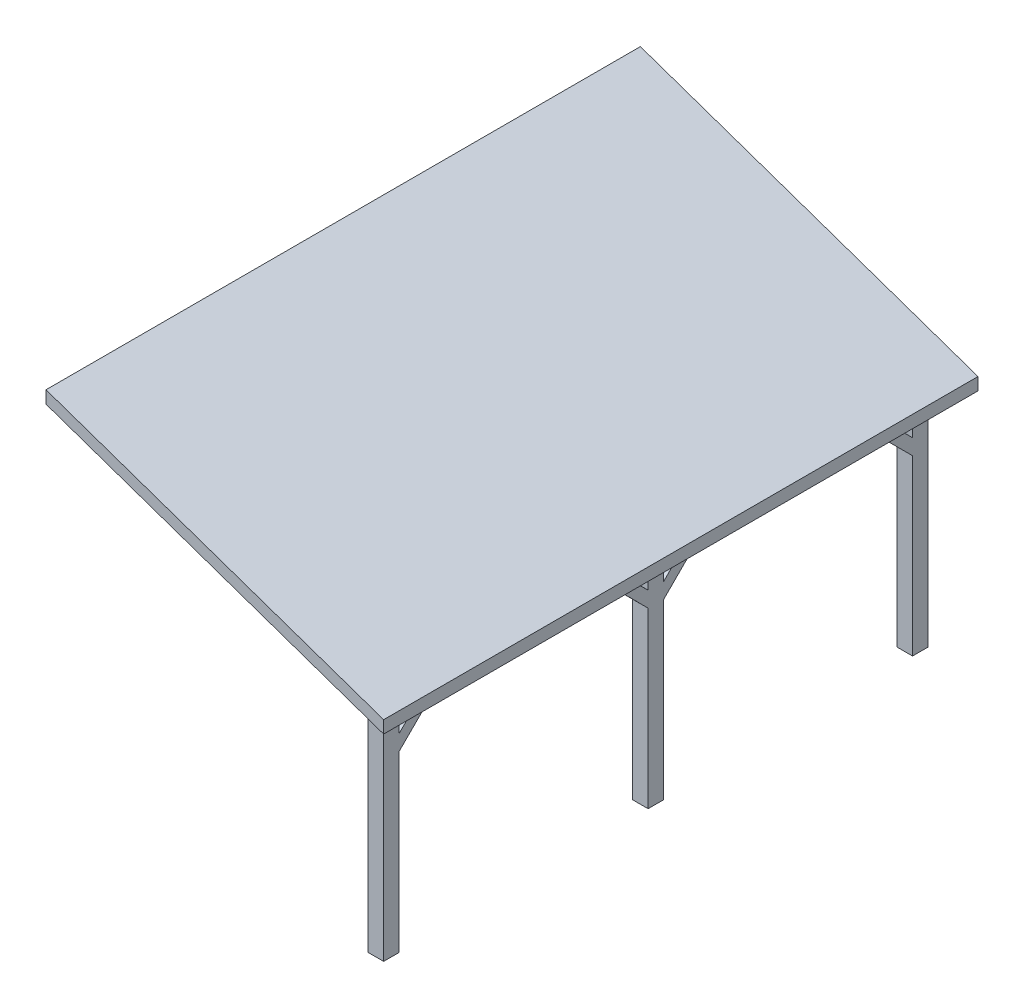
from build123d import *

# Parameters (mm, degrees)
EXTRUSION2_DEPTH        = 38.13
ENL_V_MAT_EXTRU_1_DEPTH = 50.301657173
ENL_V_MAT_EXTRU_2_DEPTH = 1.6
ENL_V_MAT_EXTRU_3_DEPTH = 1.6
ENL_V_MAT_EXTRU_4_REACH = 50.216
ENL_V_MAT_EXTRU_5_DEPTH = 1
ENL_V_MAT_EXTRU_6_DEPTH = 1
ENL_V_MAT_EXTRU_7_DEPTH = 1
ENL_V_MAT_EXTRU_8_DEPTH = 1
ENL_V_MAT_EXTRU_9_DEPTH = 1


with BuildPart() as part:
    # Esquisse1 → Extrusion2 (new body)
    with BuildSketch(Plane.XY):
        Polygon((0, 0), (0, 22.53), (21.66, 15.03), (21.66, 0), align=None)
    extrude(amount=EXTRUSION2_DEPTH)

    # Esquisse2 → Enl_v. mat.-Extru.1 (cut, through all)
    with BuildSketch(Plane.XY.offset(38.13)):
        Polygon((0, 0), (0, 21.73), (19.06, 15.130277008), (19.06, 0), align=None)
        Polygon((20.06, 0), (20.06, 14.78401662), (21.66, 14.23), (21.66, 0), align=None)
    extrude(amount=-ENL_V_MAT_EXTRU_1_DEPTH, mode=Mode.SUBTRACT)

    # Esquisse3 → Enl_v. mat.-Extru.2 (cut)
    with BuildSketch(Plane.XY.offset(38.13)):
        Polygon((19.06, 15.130277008), (20.06, 14.78401662), (20.06, 0), (19.06, 0), align=None)
    extrude(amount=-ENL_V_MAT_EXTRU_2_DEPTH, mode=Mode.SUBTRACT)

    # Esquisse4 → Enl_v. mat.-Extru.3 (cut)
    with BuildSketch(Plane(origin=(0, 0, 0), x_dir=(-1, 0, 0), z_dir=(0, 0, -1))):
        Polygon((-20.06, 0), (-20.06, 14.78401662), (-19.06, 15.130277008), (-19.06, 0), align=None)
    extrude(amount=-ENL_V_MAT_EXTRU_3_DEPTH, mode=Mode.SUBTRACT)

    # Esquisse5 → Enl_v. mat.-Extru.4 (cut, up to next)
    with BuildSketch(Plane.ZY.offset(-19.06), mode=Mode.PRIVATE) as enl_v_mat_extru_4_sk1:
        Polygon((2.6, 0), (2.6, 11.130277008), (5.6, 14.130277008), (15.565, 14.130277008), (18.565, 11.130277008), (18.565, 0), align=None)
    enl_v_mat_extru_4_tool1 = extrude(enl_v_mat_extru_4_sk1.sketch, amount=-ENL_V_MAT_EXTRU_4_REACH, mode=Mode.PRIVATE) & part.part
    add(enl_v_mat_extru_4_tool1.solids().sort_by_distance((19.06, 6.813113, 10.5825))[0], mode=Mode.SUBTRACT)

    # Esquisse6 → Enl_v. mat.-Extru.5 (cut)
    with BuildSketch(Plane.ZY.offset(-19.06)):
        Polygon((19.565, 0), (19.565, 11.143081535), (22.565, 14.160563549), (32.53, 14.160563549), (35.53, 11.17794428), (35.53, 0), align=None)
    extrude(amount=-ENL_V_MAT_EXTRU_5_DEPTH, mode=Mode.SUBTRACT)

    # Esquisse7 → Enl_v. mat.-Extru.6 (cut)
    with BuildSketch(Plane.ZY.offset(-19.06)):
        Polygon((2.6, 12.130277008), (4.6, 14.130277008), (2.6, 14.130277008), align=None)
    extrude(amount=-ENL_V_MAT_EXTRU_6_DEPTH, mode=Mode.SUBTRACT)

    # Esquisse8 → Enl_v. mat.-Extru.7 (cut)
    with BuildSketch(Plane.ZY.offset(-19.06)):
        Polygon((16.565, 14.130277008), (18.565, 14.130277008), (18.565, 12.130277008), align=None)
    extrude(amount=-ENL_V_MAT_EXTRU_7_DEPTH, mode=Mode.SUBTRACT)

    # Esquisse9 → Enl_v. mat.-Extru.8 (cut)
    with BuildSketch(Plane.ZY.offset(-19.06)):
        Polygon((19.565, 12.143081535), (19.565, 14.130277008), (21.565, 14.130277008), align=None)
    extrude(amount=-ENL_V_MAT_EXTRU_8_DEPTH, mode=Mode.SUBTRACT)

    # Esquisse10 → Enl_v. mat.-Extru.9 (cut)
    with BuildSketch(Plane.ZY.offset(-19.06)):
        Polygon((33.53, 14.130277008), (35.53, 14.130277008), (35.53, 12.17794428), align=None)
    extrude(amount=-ENL_V_MAT_EXTRU_9_DEPTH, mode=Mode.SUBTRACT)


solid = part.part
